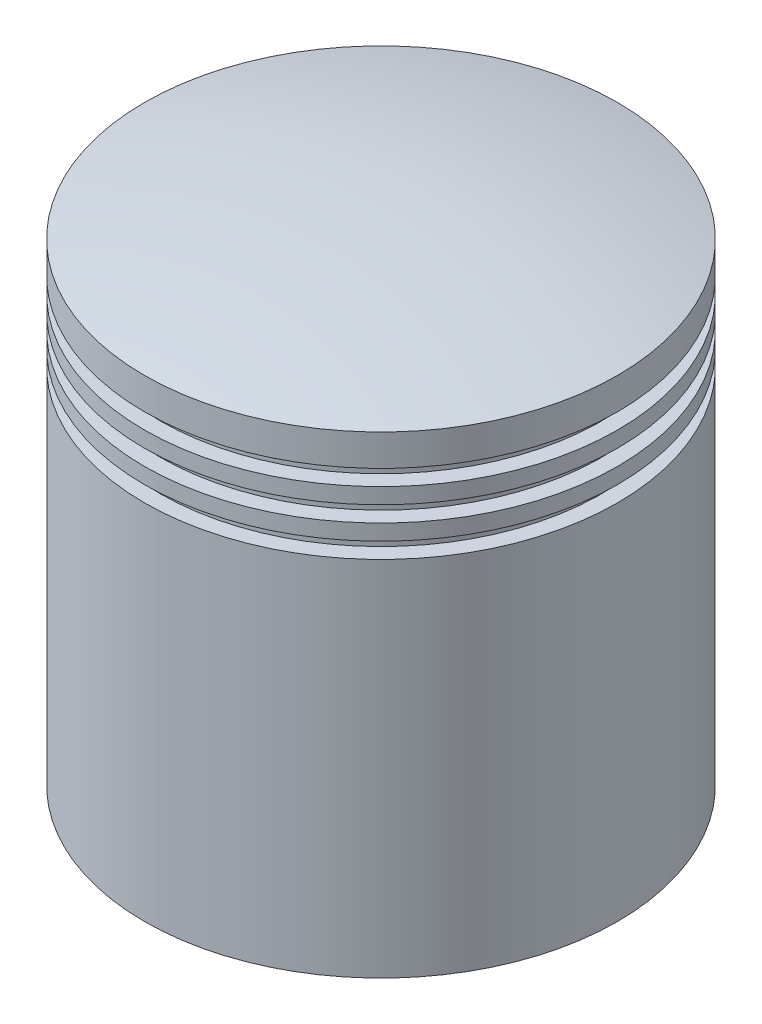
from build123d import *


with BuildPart() as part:
    # Sketch1 → Revolve1 (revolve)
    with BuildSketch(Plane.XY, mode=Mode.PRIVATE) as revolve1_sk:
        with BuildLine():
            Line((60, 135), (60, 65))
            Line((60, 65), (65, 65))
            Line((65, 65), (65, 0))
            Line((65, 0), (75, 0))
            Line((75, 0), (75, 115))
            Line((75, 115), (70, 115))
            Line((70, 115), (70, 120))
            Line((70, 120), (75, 120))
            Line((75, 120), (75, 125))
            Line((75, 125), (70, 125))
            Line((70, 125), (70, 130))
            Line((70, 130), (75, 130))
            Line((75, 130), (75, 135))
            Line((75, 135), (70, 135))
            Line((70, 135), (70, 140))
            Line((70, 140), (75, 140))
            Line((75, 140), (75, 150))
            ThreePointArc((75, 150), (37.831864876, 157.48898657), (0, 160))
            Line((0, 160), (0, 135))
            Line((0, 135), (60, 135))
        make_face()
    revolve(revolve1_sk.sketch.rotate(Axis((0, 160, 0), (0, -1, 0)), 90), axis=Axis((0, 160, 0), (0, -1, 0)))


solid = part.part
